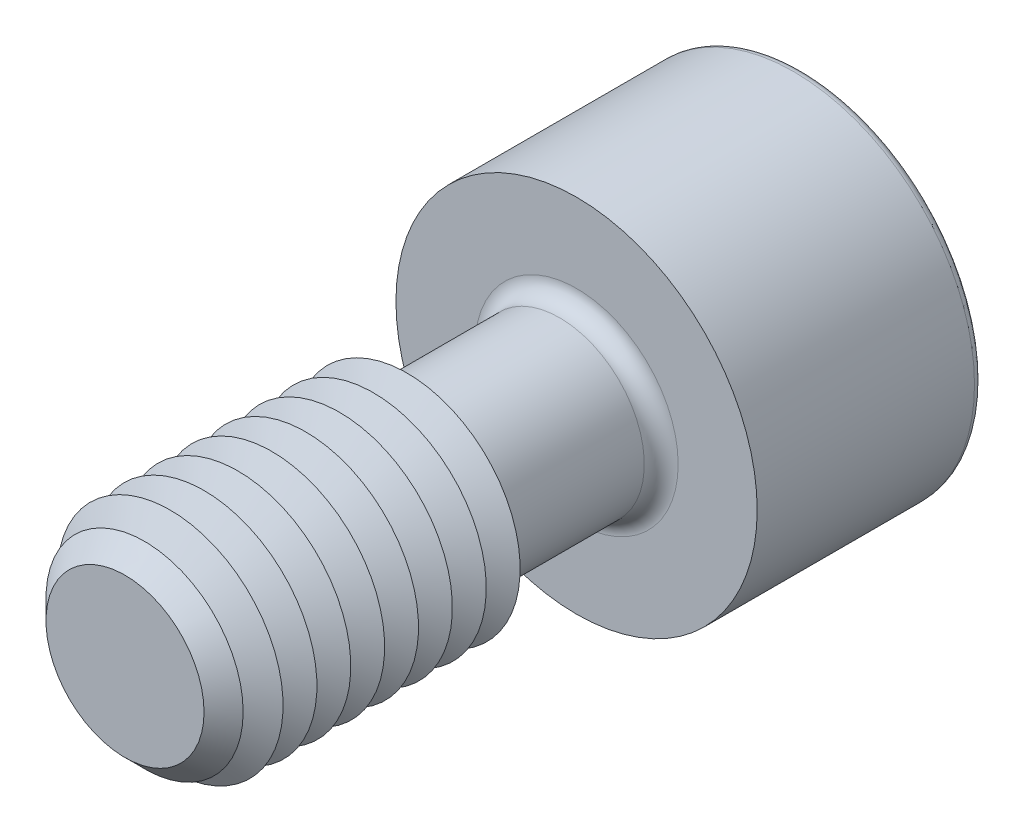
from build123d import *

# Parameters (mm, degrees)
SKETCH1_R       = 3.75
EXTRUDE1_DEPTH  = 10
CHAMFER1_SIZE   = 1.5
SKETCH3_R       = 8
EXTRUDE2_DEPTH  = 10
EXTRUDE3_DEPTH  = 8
FILLET1_R       = 0.75
FILLET2_R       = 0.375
LPATTERN1_COUNT = 8
LPATTERN1_PITCH = 1.5


with BuildPart() as part:
    # Sketch1 → Extrude1 (new, symmetric)
    with BuildSketch(Plane.XY):
        Circle(SKETCH1_R)
    extrude(amount=EXTRUDE1_DEPTH, both=True)

    # Sketch2 → Revolve1 (revolve)
    with BuildSketch(Plane(origin=(0, 0, 0), x_dir=(0, 0, -1), z_dir=(1, 0, 0))):
        Polygon((-10, 0), (-10, 5), (2.5, 5), (3.221687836, 3.75), (3.221687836, 0), align=None)
    revolve(axis=Axis((0, 0, -3.221687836), (0, 0, 1)))

    # Chamfer1
    chamfer1_edges = [part.edges().sort_by_distance(p)[0] for p in [
        (0, -5, 10),
    ]]
    chamfer(chamfer1_edges, length=CHAMFER1_SIZE)

    # Sketch3 → Extrude2 (add)
    with BuildSketch(Plane(origin=(0, 0, -10), x_dir=(-1, 0, 0), z_dir=(0, 0, -1))):
        Circle(SKETCH3_R)
    extrude(amount=EXTRUDE2_DEPTH)

    # Sketch4 → Extrude3 (cut)
    with BuildSketch(Plane(origin=(-13.7, 0, -20), x_dir=(1, 0, 0), z_dir=(0, 0, 1))):
        Polygon((11.390598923, -4), (16.009401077, -4), (18.318802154, 0), (16.009401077, 4), (11.390598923, 4), (9.081197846, 0), align=None)
    extrude(amount=EXTRUDE3_DEPTH, mode=Mode.SUBTRACT)

    # Fillet1
    fillet1_edges = [part.edges().sort_by_distance(p)[0] for p in [
        (-3.75, 0, -10),
    ]]
    fillet(fillet1_edges, radius=FILLET1_R)

    # Fillet2
    fillet2_edges = [part.edges().sort_by_distance(p)[0] for p in [
        (8, 0, -20),
    ]]
    fillet(fillet2_edges, radius=FILLET2_R)

    # Sketch5 → Cut-Revolve1 (revolve, cut)
    with BuildSketch(Plane(origin=(0, 0, 0), x_dir=(0, 0, -1), z_dir=(1, 0, 0)), mode=Mode.PRIVATE) as cut_revolve1_sk:
        Polygon((12, 0), (12, -4), (9.690598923, 0), align=None)
    revolve(cut_revolve1_sk.sketch.rotate(Axis((0, 0, -9.690598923), (0, 0, -1)), 90), axis=Axis((0, 0, -9.690598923), (0, 0, -1)), mode=Mode.SUBTRACT)

    # Sketch7 → Cut-Revolve2 (revolve, cut)
    with BuildSketch(Plane(origin=(0, 0, 0), x_dir=(0, 0, -1), z_dir=(1, 0, 0)), mode=Mode.PRIVATE) as cut_revolve2_sk:
        Polygon((2.5, 5), (1.75, 3.700961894), (1, 5), align=None)
    cut_revolve2 = revolve(cut_revolve2_sk.sketch.rotate(Axis((0, 0, -1.332048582), (0, 0, 1)), 90), axis=Axis((0, 0, -1.332048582), (0, 0, 1)), mode=Mode.SUBTRACT)

    # LPattern1: Cut-Revolve2 ×8
    with Locations(*[(0, 0, i * LPATTERN1_PITCH) for i in range(1, LPATTERN1_COUNT)]):
        add(cut_revolve2, mode=Mode.SUBTRACT)


solid = part.part
